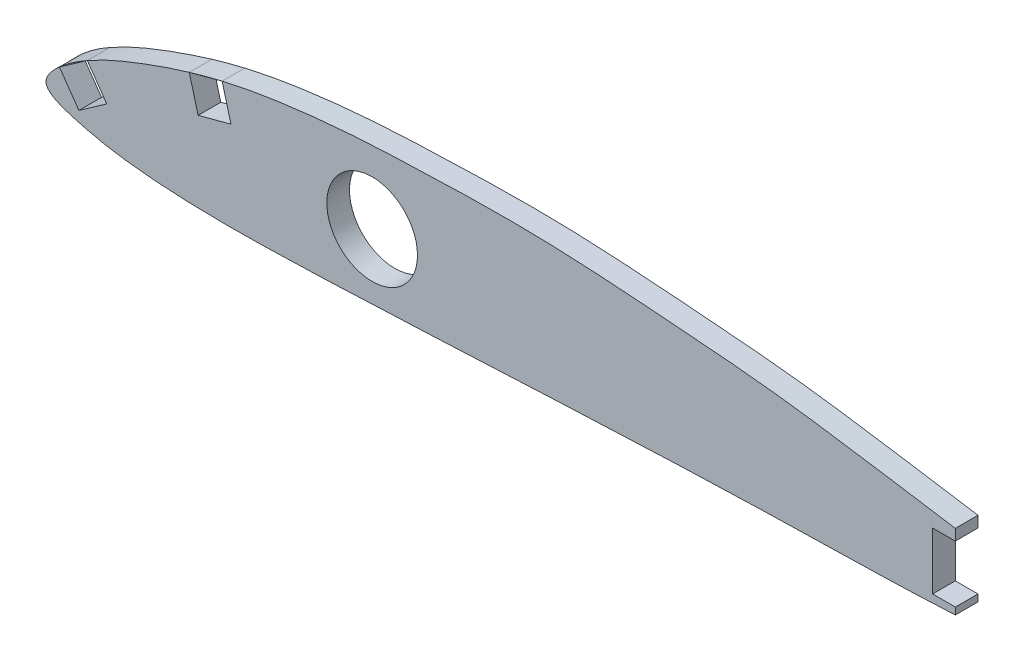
ISO-10303-21;
HEADER;
FILE_DESCRIPTION(('STEP AP214'),'2;1');
FILE_NAME('part.step','',(''),(''),'','','');
FILE_SCHEMA(('AUTOMOTIVE_DESIGN { 1 0 10303 214 1 1 1 1 }'));
ENDSEC;
DATA;
#1=APPLICATION_CONTEXT('core data for automotive mechanical design processes');
#2=APPLICATION_PROTOCOL_DEFINITION('international standard','automotive_design',2000,#1);
#3=PRODUCT_CONTEXT('',#1,'mechanical');
#4=PRODUCT('Part','Part','',(#3));
#5=PRODUCT_RELATED_PRODUCT_CATEGORY('part','',(#4));
#6=PRODUCT_DEFINITION_FORMATION('','',#4);
#7=PRODUCT_DEFINITION_CONTEXT('part definition',#1,'design');
#8=PRODUCT_DEFINITION('design','',#6,#7);
#9=PRODUCT_DEFINITION_SHAPE('','',#8);
#10=(LENGTH_UNIT() NAMED_UNIT(*) SI_UNIT(.MILLI.,.METRE.));
#11=(NAMED_UNIT(*) PLANE_ANGLE_UNIT() SI_UNIT($,.RADIAN.));
#12=(NAMED_UNIT(*) SI_UNIT($,.STERADIAN.) SOLID_ANGLE_UNIT());
#13=UNCERTAINTY_MEASURE_WITH_UNIT(LENGTH_MEASURE(1.E-05),#10,'distance_accuracy_value','');
#14=(GEOMETRIC_REPRESENTATION_CONTEXT(3) GLOBAL_UNCERTAINTY_ASSIGNED_CONTEXT((#13)) GLOBAL_UNIT_ASSIGNED_CONTEXT((#10,
#11,#12)) REPRESENTATION_CONTEXT('',''));
#15=CARTESIAN_POINT('',(0.,0.,0.));
#16=DIRECTION('',(0.,0.,1.));
#17=DIRECTION('',(1.,0.,0.));
#18=AXIS2_PLACEMENT_3D('',#15,#16,#17);
#19=CARTESIAN_POINT('',(0.,0.,0.));
#20=DIRECTION('',(0.,0.,-1.));
#21=DIRECTION('',(-1.,0.,0.));
#22=AXIS2_PLACEMENT_3D('',#19,#20,#21);
#23=PLANE('',#22);
#24=DIRECTION('',(0.,1.,0.));
#25=VECTOR('',#24,1.);
#26=CARTESIAN_POINT('',(127.362,0.,0.));
#27=LINE('',#26,#25);
#28=CARTESIAN_POINT('',(127.362,8.,0.));
#29=VERTEX_POINT('',#28);
#30=CARTESIAN_POINT('',(127.362,9.54645736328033,0.));
#31=VERTEX_POINT('',#30);
#32=EDGE_CURVE('E157',#29,#31,#27,.T.);
#33=ORIENTED_EDGE('',*,*,#32,.F.);
#34=DIRECTION('',(1.,0.,0.));
#35=VECTOR('',#34,1.);
#36=CARTESIAN_POINT('',(0.,8.,0.));
#37=LINE('',#36,#35);
#38=CARTESIAN_POINT('',(124.187,8.,0.));
#39=VERTEX_POINT('',#38);
#40=EDGE_CURVE('E65',#39,#29,#37,.T.);
#41=ORIENTED_EDGE('',*,*,#40,.F.);
#42=DIRECTION('',(0.,1.,0.));
#43=VECTOR('',#42,1.);
#44=CARTESIAN_POINT('',(124.187,0.,0.));
#45=LINE('',#44,#43);
#46=CARTESIAN_POINT('',(124.187,0.,0.));
#47=VERTEX_POINT('',#46);
#48=EDGE_CURVE('E229',#47,#39,#45,.T.);
#49=ORIENTED_EDGE('',*,*,#48,.F.);
#50=DIRECTION('',(-1.,0.,0.));
#51=VECTOR('',#50,1.);
#52=CARTESIAN_POINT('',(0.,1.60692808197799E-12,0.));
#53=LINE('',#52,#51);
#54=CARTESIAN_POINT('',(127.362,0.,0.));
#55=VERTEX_POINT('',#54);
#56=EDGE_CURVE('E134',#55,#47,#53,.T.);
#57=ORIENTED_EDGE('',*,*,#56,.F.);
#58=DIRECTION('',(0.,1.,0.));
#59=VECTOR('',#58,1.);
#60=CARTESIAN_POINT('',(127.362,0.,0.));
#61=LINE('',#60,#59);
#62=CARTESIAN_POINT('',(127.362,-0.966233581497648,0.));
#63=VERTEX_POINT('',#62);
#64=EDGE_CURVE('E198',#63,#55,#61,.T.);
#65=ORIENTED_EDGE('',*,*,#64,.F.);
#66=CARTESIAN_POINT('',(0.,0.,0.));
#67=CARTESIAN_POINT('',(-0.0472103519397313,0.916800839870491,0.));
#68=CARTESIAN_POINT('',(1.95472681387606,2.97484692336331,0.));
#69=CARTESIAN_POINT('',(4.79809564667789,5.01128965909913,0.));
#70=CARTESIAN_POINT('',(8.48331335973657,6.99574566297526,0.));
#71=CARTESIAN_POINT('',(15.5406404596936,9.86646560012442,0.));
#72=CARTESIAN_POINT('',(24.1015958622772,12.5978770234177,0.));
#73=CARTESIAN_POINT('',(34.2353450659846,14.2184425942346,0.));
#74=CARTESIAN_POINT('',(42.8242854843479,15.0755900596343,0.));
#75=CARTESIAN_POINT('',(54.2570057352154,15.5547360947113,0.));
#76=CARTESIAN_POINT('',(68.5622896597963,15.9604747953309,0.));
#77=CARTESIAN_POINT('',(85.6836883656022,14.7588221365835,0.));
#78=CARTESIAN_POINT('',(102.928702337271,13.4150923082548,0.));
#79=CARTESIAN_POINT('',(119.782412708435,10.7152566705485,0.));
#80=CARTESIAN_POINT('',(137.861885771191,7.95134817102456,0.));
#81=CARTESIAN_POINT('',(151.659475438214,4.70539478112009,0.));
#82=CARTESIAN_POINT('',(181.030093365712,-1.11239211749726,0.));
#83=CARTESIAN_POINT('',(143.027519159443,0.226149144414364,0.));
#84=CARTESIAN_POINT('',(126.501098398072,-1.28628115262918,0.));
#85=CARTESIAN_POINT('',(90.825011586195,-1.84867484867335,0.));
#86=CARTESIAN_POINT('',(62.9371348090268,-3.36825391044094,0.));
#87=CARTESIAN_POINT('',(34.2240872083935,-4.61982857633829,0.));
#88=CARTESIAN_POINT('',(20.1131584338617,-4.85120808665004,0.));
#89=CARTESIAN_POINT('',(9.7268299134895,-3.84526071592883,0.));
#90=CARTESIAN_POINT('',(4.43930579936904,-2.63627209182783,0.));
#91=CARTESIAN_POINT('',(0.0647848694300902,-1.25808896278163,0.));
#92=CARTESIAN_POINT('',(0.,0.,0.));
#93=B_SPLINE_CURVE_WITH_KNOTS('',3,(#66,#67,#68,#69,#70,#71,#72,#73,#74,#75,#76,#77,#78,#79,#80,
#81,#82,#83,#84,#85,#86,#87,#88,#89,#90,#91,#92),.UNSPECIFIED.,.T.,.F.,(4,1,1,1,1,1,1,1,1,1,1,1,
1,1,1,1,1,1,1,1,1,1,1,1,4),(0.,0.0105604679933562,0.0182111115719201,0.0322098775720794,
0.0455249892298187,0.0840694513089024,0.10897429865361,0.133649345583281,0.158232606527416,
0.207343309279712,0.25652270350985,0.30582635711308,0.355445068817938,0.40521420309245,
0.4553904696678,0.506006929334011,0.555121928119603,0.653369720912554,0.702490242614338,
0.849938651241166,0.899083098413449,0.948194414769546,0.972905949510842,0.985508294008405,1.),.UNSPECIFIED.);
#94=CARTESIAN_POINT('',(1.8788598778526,2.76698132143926,0.));
#95=VERTEX_POINT('',#94);
#96=EDGE_CURVE('E183',#63,#95,#93,.T.);
#97=ORIENTED_EDGE('',*,*,#96,.T.);
#98=DIRECTION('',(-0.573576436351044,0.819152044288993,0.));
#99=VECTOR('',#98,1.);
#100=CARTESIAN_POINT('',(2.56078986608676,1.79308436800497,0.));
#101=LINE('',#100,#99);
#102=CARTESIAN_POINT('',(4.61051765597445,-1.13423028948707,0.));
#103=VERTEX_POINT('',#102);
#104=EDGE_CURVE('E197',#103,#95,#101,.T.);
#105=ORIENTED_EDGE('',*,*,#104,.F.);
#106=DIRECTION('',(-0.819152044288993,-0.573576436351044,0.));
#107=VECTOR('',#106,1.);
#108=CARTESIAN_POINT('',(2.04972778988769,-2.92731465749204,0.));
#109=LINE('',#108,#107);
#110=CARTESIAN_POINT('',(8.51172926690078,1.59742748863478,0.));
#111=VERTEX_POINT('',#110);
#112=EDGE_CURVE('E211',#111,#103,#109,.T.);
#113=ORIENTED_EDGE('',*,*,#112,.F.);
#114=DIRECTION('',(0.573576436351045,-0.819152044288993,0.));
#115=VECTOR('',#114,1.);
#116=CARTESIAN_POINT('',(6.46200147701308,4.52474214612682,0.));
#117=LINE('',#116,#115);
#118=CARTESIAN_POINT('',(5.78007148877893,5.49863909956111,0.));
#119=VERTEX_POINT('',#118);
#120=EDGE_CURVE('E221',#119,#111,#117,.T.);
#121=ORIENTED_EDGE('',*,*,#120,.F.);
#122=CARTESIAN_POINT('',(20.0713171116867,11.2118779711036,0.));
#123=VERTEX_POINT('',#122);
#124=EDGE_CURVE('E181',#119,#123,#93,.T.);
#125=ORIENTED_EDGE('',*,*,#124,.T.);
#126=DIRECTION('',(-0.258819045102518,0.965925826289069,0.));
#127=VECTOR('',#126,1.);
#128=CARTESIAN_POINT('',(21.5297633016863,5.76888268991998,0.));
#129=LINE('',#128,#127);
#130=CARTESIAN_POINT('',(21.3039428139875,6.6116562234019,0.));
#131=VERTEX_POINT('',#130);
#132=EDGE_CURVE('E251',#131,#123,#129,.T.);
#133=ORIENTED_EDGE('',*,*,#132,.F.);
#134=DIRECTION('',(-0.965925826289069,-0.258819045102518,0.));
#135=VECTOR('',#134,1.);
#136=CARTESIAN_POINT('',(-0.225820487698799,0.84277353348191,0.));
#137=LINE('',#136,#135);
#138=CARTESIAN_POINT('',(25.9041645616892,7.84428192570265,0.));
#139=VERTEX_POINT('',#138);
#140=EDGE_CURVE('E244',#139,#131,#137,.T.);
#141=ORIENTED_EDGE('',*,*,#140,.F.);
#142=DIRECTION('',(0.258819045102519,-0.965925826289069,0.));
#143=VECTOR('',#142,1.);
#144=CARTESIAN_POINT('',(26.1299850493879,7.00150839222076,0.));
#145=LINE('',#144,#143);
#146=CARTESIAN_POINT('',(24.6715388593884,12.4445036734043,0.));
#147=VERTEX_POINT('',#146);
#148=EDGE_CURVE('E180',#147,#139,#145,.T.);
#149=ORIENTED_EDGE('',*,*,#148,.F.);
#150=EDGE_CURVE('E172',#147,#31,#93,.T.);
#151=ORIENTED_EDGE('',*,*,#150,.T.);
#152=EDGE_LOOP('',(#33,#41,#49,#57,#65,#97,#105,#113,#121,#125,#133,#141,#149,#151));
#153=FACE_BOUND('',#152,.T.);
#154=CARTESIAN_POINT('',(45.68,4.99999999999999,0.));
#155=DIRECTION('',(0.,0.,-1.));
#156=DIRECTION('',(-1.,0.,0.));
#157=AXIS2_PLACEMENT_3D('',#154,#155,#156);
#158=CIRCLE('',#157,6.35);
#159=CARTESIAN_POINT('',(39.33,4.99999999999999,0.));
#160=VERTEX_POINT('',#159);
#161=EDGE_CURVE('E279',#160,#160,#158,.T.);
#162=ORIENTED_EDGE('',*,*,#161,.F.);
#163=EDGE_LOOP('',(#162));
#164=FACE_BOUND('',#163,.T.);
#165=ADVANCED_FACE('F45',(#153,#164),#23,.T.);
#166=CARTESIAN_POINT('',(0.,0.,3.175));
#167=DIRECTION('',(0.,0.,-1.));
#168=DIRECTION('',(-1.,0.,0.));
#169=AXIS2_PLACEMENT_3D('',#166,#167,#168);
#170=PLANE('',#169);
#171=CARTESIAN_POINT('',(45.68,4.99999999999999,3.175));
#172=DIRECTION('',(0.,0.,1.));
#173=DIRECTION('',(1.,0.,0.));
#174=AXIS2_PLACEMENT_3D('',#171,#172,#173);
#175=CIRCLE('',#174,6.35);
#176=CARTESIAN_POINT('',(52.03,4.99999999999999,3.175));
#177=VERTEX_POINT('',#176);
#178=EDGE_CURVE('E253',#177,#177,#175,.T.);
#179=ORIENTED_EDGE('',*,*,#178,.F.);
#180=EDGE_LOOP('',(#179));
#181=FACE_BOUND('',#180,.T.);
#182=DIRECTION('',(-1.,0.,0.));
#183=VECTOR('',#182,1.);
#184=CARTESIAN_POINT('',(124.187,8.,3.175));
#185=LINE('',#184,#183);
#186=CARTESIAN_POINT('',(127.362,8.,3.175));
#187=VERTEX_POINT('',#186);
#188=CARTESIAN_POINT('',(124.187,8.,3.175));
#189=VERTEX_POINT('',#188);
#190=EDGE_CURVE('E13',#187,#189,#185,.T.);
#191=ORIENTED_EDGE('',*,*,#190,.F.);
#192=DIRECTION('',(0.,-1.,0.));
#193=VECTOR('',#192,1.);
#194=CARTESIAN_POINT('',(127.362,17.1037438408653,3.175));
#195=LINE('',#194,#193);
#196=CARTESIAN_POINT('',(127.362,9.54645736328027,3.175));
#197=VERTEX_POINT('',#196);
#198=EDGE_CURVE('E164',#197,#187,#195,.T.);
#199=ORIENTED_EDGE('',*,*,#198,.F.);
#200=CARTESIAN_POINT('',(0.,0.,3.175));
#201=CARTESIAN_POINT('',(-0.0472103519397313,0.916800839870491,3.175));
#202=CARTESIAN_POINT('',(1.95472681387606,2.97484692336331,3.175));
#203=CARTESIAN_POINT('',(4.79809564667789,5.01128965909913,3.175));
#204=CARTESIAN_POINT('',(8.48331335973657,6.99574566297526,3.175));
#205=CARTESIAN_POINT('',(15.5406404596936,9.86646560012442,3.175));
#206=CARTESIAN_POINT('',(24.1015958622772,12.5978770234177,3.175));
#207=CARTESIAN_POINT('',(34.2353450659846,14.2184425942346,3.175));
#208=CARTESIAN_POINT('',(42.8242854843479,15.0755900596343,3.175));
#209=CARTESIAN_POINT('',(54.2570057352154,15.5547360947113,3.175));
#210=CARTESIAN_POINT('',(68.5622896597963,15.9604747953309,3.175));
#211=CARTESIAN_POINT('',(85.6836883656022,14.7588221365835,3.175));
#212=CARTESIAN_POINT('',(102.928702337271,13.4150923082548,3.175));
#213=CARTESIAN_POINT('',(119.782412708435,10.7152566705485,3.175));
#214=CARTESIAN_POINT('',(137.861885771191,7.95134817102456,3.175));
#215=CARTESIAN_POINT('',(151.659475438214,4.70539478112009,3.175));
#216=CARTESIAN_POINT('',(181.030093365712,-1.11239211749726,3.175));
#217=CARTESIAN_POINT('',(143.027519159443,0.226149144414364,3.175));
#218=CARTESIAN_POINT('',(126.501098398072,-1.28628115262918,3.175));
#219=CARTESIAN_POINT('',(90.825011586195,-1.84867484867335,3.175));
#220=CARTESIAN_POINT('',(62.9371348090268,-3.36825391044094,3.175));
#221=CARTESIAN_POINT('',(34.2240872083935,-4.61982857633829,3.175));
#222=CARTESIAN_POINT('',(20.1131584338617,-4.85120808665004,3.175));
#223=CARTESIAN_POINT('',(9.7268299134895,-3.84526071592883,3.175));
#224=CARTESIAN_POINT('',(4.43930579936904,-2.63627209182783,3.175));
#225=CARTESIAN_POINT('',(0.0647848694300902,-1.25808896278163,3.175));
#226=CARTESIAN_POINT('',(0.,0.,3.175));
#227=B_SPLINE_CURVE_WITH_KNOTS('',3,(#200,#201,#202,#203,#204,#205,#206,#207,#208,#209,#210,
#211,#212,#213,#214,#215,#216,#217,#218,#219,#220,#221,#222,#223,#224,#225,#226),.UNSPECIFIED.,
.T.,.F.,(4,1,1,1,1,1,1,1,1,1,1,1,1,1,1,1,1,1,1,1,1,1,1,1,4),(0.,0.0105604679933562,
0.0182111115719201,0.0322098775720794,0.0455249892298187,0.0840694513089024,0.10897429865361,
0.133649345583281,0.158232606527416,0.207343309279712,0.25652270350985,0.30582635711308,
0.355445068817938,0.40521420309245,0.4553904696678,0.506006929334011,0.555121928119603,
0.653369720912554,0.702490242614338,0.849938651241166,0.899083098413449,0.948194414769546,
0.972905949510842,0.985508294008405,1.),.UNSPECIFIED.);
#228=CARTESIAN_POINT('',(24.6715388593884,12.4445036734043,3.175));
#229=VERTEX_POINT('',#228);
#230=EDGE_CURVE('E175',#229,#197,#227,.T.);
#231=ORIENTED_EDGE('',*,*,#230,.F.);
#232=DIRECTION('',(-0.258819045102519,0.965925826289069,0.));
#233=VECTOR('',#232,1.);
#234=CARTESIAN_POINT('',(24.6715388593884,12.4445036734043,3.175));
#235=LINE('',#234,#233);
#236=CARTESIAN_POINT('',(25.9041645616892,7.84428192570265,3.175));
#237=VERTEX_POINT('',#236);
#238=EDGE_CURVE('E246',#237,#229,#235,.T.);
#239=ORIENTED_EDGE('',*,*,#238,.F.);
#240=DIRECTION('',(0.965925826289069,0.258819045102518,0.));
#241=VECTOR('',#240,1.);
#242=CARTESIAN_POINT('',(21.3039428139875,6.6116562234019,3.175));
#243=LINE('',#242,#241);
#244=CARTESIAN_POINT('',(21.3039428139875,6.6116562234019,3.175));
#245=VERTEX_POINT('',#244);
#246=EDGE_CURVE('E249',#245,#237,#243,.T.);
#247=ORIENTED_EDGE('',*,*,#246,.F.);
#248=DIRECTION('',(0.258819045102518,-0.965925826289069,0.));
#249=VECTOR('',#248,1.);
#250=CARTESIAN_POINT('',(20.0713171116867,11.2118779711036,3.175));
#251=LINE('',#250,#249);
#252=CARTESIAN_POINT('',(20.0713171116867,11.2118779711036,3.175));
#253=VERTEX_POINT('',#252);
#254=EDGE_CURVE('E256',#253,#245,#251,.T.);
#255=ORIENTED_EDGE('',*,*,#254,.F.);
#256=CARTESIAN_POINT('',(5.78007148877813,5.49863909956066,3.175));
#257=VERTEX_POINT('',#256);
#258=EDGE_CURVE('E184',#257,#253,#227,.T.);
#259=ORIENTED_EDGE('',*,*,#258,.F.);
#260=DIRECTION('',(-0.573576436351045,0.819152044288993,0.));
#261=VECTOR('',#260,1.);
#262=CARTESIAN_POINT('',(5.78007148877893,5.49863909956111,3.175));
#263=LINE('',#262,#261);
#264=CARTESIAN_POINT('',(8.51172926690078,1.59742748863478,3.175));
#265=VERTEX_POINT('',#264);
#266=EDGE_CURVE('E212',#265,#257,#263,.T.);
#267=ORIENTED_EDGE('',*,*,#266,.F.);
#268=DIRECTION('',(0.819152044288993,0.573576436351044,0.));
#269=VECTOR('',#268,1.);
#270=CARTESIAN_POINT('',(8.51172926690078,1.59742748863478,3.175));
#271=LINE('',#270,#269);
#272=CARTESIAN_POINT('',(4.61051765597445,-1.13423028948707,3.175));
#273=VERTEX_POINT('',#272);
#274=EDGE_CURVE('E207',#273,#265,#271,.T.);
#275=ORIENTED_EDGE('',*,*,#274,.F.);
#276=DIRECTION('',(0.573576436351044,-0.819152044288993,0.));
#277=VECTOR('',#276,1.);
#278=CARTESIAN_POINT('',(1.8788598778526,2.76698132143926,3.175));
#279=LINE('',#278,#277);
#280=CARTESIAN_POINT('',(1.8788598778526,2.76698132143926,3.175));
#281=VERTEX_POINT('',#280);
#282=EDGE_CURVE('E165',#281,#273,#279,.T.);
#283=ORIENTED_EDGE('',*,*,#282,.F.);
#284=CARTESIAN_POINT('',(127.362000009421,-0.966233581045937,3.175));
#285=VERTEX_POINT('',#284);
#286=EDGE_CURVE('E185',#285,#281,#227,.T.);
#287=ORIENTED_EDGE('',*,*,#286,.F.);
#288=DIRECTION('',(0.,-1.,0.));
#289=VECTOR('',#288,1.);
#290=CARTESIAN_POINT('',(127.362,0.,3.175));
#291=LINE('',#290,#289);
#292=CARTESIAN_POINT('',(127.362,0.,3.175));
#293=VERTEX_POINT('',#292);
#294=EDGE_CURVE('E234',#293,#285,#291,.T.);
#295=ORIENTED_EDGE('',*,*,#294,.F.);
#296=DIRECTION('',(1.,0.,0.));
#297=VECTOR('',#296,1.);
#298=CARTESIAN_POINT('',(124.187,0.,3.175));
#299=LINE('',#298,#297);
#300=CARTESIAN_POINT('',(124.187,0.,3.175));
#301=VERTEX_POINT('',#300);
#302=EDGE_CURVE('E231',#301,#293,#299,.T.);
#303=ORIENTED_EDGE('',*,*,#302,.F.);
#304=DIRECTION('',(0.,-1.,0.));
#305=VECTOR('',#304,1.);
#306=CARTESIAN_POINT('',(124.187,8.,3.175));
#307=LINE('',#306,#305);
#308=EDGE_CURVE('E228',#189,#301,#307,.T.);
#309=ORIENTED_EDGE('',*,*,#308,.F.);
#310=EDGE_LOOP('',(#191,#199,#231,#239,#247,#255,#259,#267,#275,#283,#287,#295,#303,#309));
#311=FACE_BOUND('',#310,.T.);
#312=ADVANCED_FACE('F273',(#181,#311),#170,.F.);
#313=DIRECTION('',(0.,0.,1.));
#314=VECTOR('',#313,1.);
#315=SURFACE_OF_LINEAR_EXTRUSION('',#93,#314);
#316=ORIENTED_EDGE('',*,*,#230,.T.);
#317=DIRECTION('',(0.,0.,1.));
#318=VECTOR('',#317,1.);
#319=CARTESIAN_POINT('',(127.362,9.54645736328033,0.));
#320=LINE('',#319,#318);
#321=EDGE_CURVE('E160',#197,#31,#320,.F.);
#322=ORIENTED_EDGE('',*,*,#321,.T.);
#323=ORIENTED_EDGE('',*,*,#150,.F.);
#324=DIRECTION('',(0.,0.,1.));
#325=VECTOR('',#324,1.);
#326=CARTESIAN_POINT('',(24.6715388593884,12.4445036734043,0.));
#327=LINE('',#326,#325);
#328=EDGE_CURVE('E176',#147,#229,#327,.T.);
#329=ORIENTED_EDGE('',*,*,#328,.T.);
#330=EDGE_LOOP('',(#316,#322,#323,#329));
#331=FACE_BOUND('',#330,.T.);
#332=ADVANCED_FACE('F170',(#331),#315,.F.);
#333=ORIENTED_EDGE('',*,*,#96,.F.);
#334=DIRECTION('',(0.,0.,1.));
#335=VECTOR('',#334,1.);
#336=CARTESIAN_POINT('',(127.362,-0.966233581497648,0.));
#337=LINE('',#336,#335);
#338=EDGE_CURVE('E202',#63,#285,#337,.T.);
#339=ORIENTED_EDGE('',*,*,#338,.T.);
#340=ORIENTED_EDGE('',*,*,#286,.T.);
#341=DIRECTION('',(0.,0.,1.));
#342=VECTOR('',#341,1.);
#343=CARTESIAN_POINT('',(1.87885987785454,2.76698132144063,0.));
#344=LINE('',#343,#342);
#345=EDGE_CURVE('E152',#95,#281,#344,.T.);
#346=ORIENTED_EDGE('',*,*,#345,.F.);
#347=EDGE_LOOP('',(#333,#339,#340,#346));
#348=FACE_BOUND('',#347,.T.);
#349=ADVANCED_FACE('F201',(#348),#315,.F.);
#350=DIRECTION('',(0.,0.,1.));
#351=VECTOR('',#350,1.);
#352=CARTESIAN_POINT('',(5.78007148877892,5.49863909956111,0.));
#353=LINE('',#352,#351);
#354=EDGE_CURVE('E210',#257,#119,#353,.F.);
#355=ORIENTED_EDGE('',*,*,#354,.F.);
#356=ORIENTED_EDGE('',*,*,#258,.T.);
#357=DIRECTION('',(0.,0.,1.));
#358=VECTOR('',#357,1.);
#359=CARTESIAN_POINT('',(20.0713171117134,11.2118779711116,0.));
#360=LINE('',#359,#358);
#361=EDGE_CURVE('E48',#123,#253,#360,.T.);
#362=ORIENTED_EDGE('',*,*,#361,.F.);
#363=ORIENTED_EDGE('',*,*,#124,.F.);
#364=EDGE_LOOP('',(#355,#356,#362,#363));
#365=FACE_BOUND('',#364,.T.);
#366=ADVANCED_FACE('F300',(#365),#315,.F.);
#367=CARTESIAN_POINT('',(45.68,4.99999999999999,-6.825));
#368=DIRECTION('',(0.,0.,1.));
#369=DIRECTION('',(1.,0.,0.));
#370=AXIS2_PLACEMENT_3D('',#367,#368,#369);
#371=CYLINDRICAL_SURFACE('',#370,6.35);
#372=ORIENTED_EDGE('',*,*,#161,.T.);
#373=EDGE_LOOP('',(#372));
#374=FACE_BOUND('',#373,.T.);
#375=ORIENTED_EDGE('',*,*,#178,.T.);
#376=EDGE_LOOP('',(#375));
#377=FACE_BOUND('',#376,.T.);
#378=ADVANCED_FACE('F292',(#374,#377),#371,.F.);
#379=CARTESIAN_POINT('',(20.0713171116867,11.2118779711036,-6.825));
#380=DIRECTION('',(-0.965925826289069,-0.258819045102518,0.));
#381=DIRECTION('',(0.258819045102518,-0.965925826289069,0.));
#382=AXIS2_PLACEMENT_3D('',#379,#380,#381);
#383=PLANE('',#382);
#384=ORIENTED_EDGE('',*,*,#132,.T.);
#385=ORIENTED_EDGE('',*,*,#361,.T.);
#386=ORIENTED_EDGE('',*,*,#254,.T.);
#387=DIRECTION('',(0.,0.,1.));
#388=VECTOR('',#387,1.);
#389=CARTESIAN_POINT('',(21.3039428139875,6.6116562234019,-6.825));
#390=LINE('',#389,#388);
#391=EDGE_CURVE('E245',#131,#245,#390,.T.);
#392=ORIENTED_EDGE('',*,*,#391,.F.);
#393=EDGE_LOOP('',(#384,#385,#386,#392));
#394=FACE_BOUND('',#393,.T.);
#395=ADVANCED_FACE('F330',(#394),#383,.F.);
#396=CARTESIAN_POINT('',(24.6715388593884,12.4445036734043,-6.825));
#397=DIRECTION('',(0.965925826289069,0.258819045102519,0.));
#398=DIRECTION('',(-0.258819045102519,0.965925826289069,0.));
#399=AXIS2_PLACEMENT_3D('',#396,#397,#398);
#400=PLANE('',#399);
#401=ORIENTED_EDGE('',*,*,#148,.T.);
#402=DIRECTION('',(0.,0.,1.));
#403=VECTOR('',#402,1.);
#404=CARTESIAN_POINT('',(25.9041645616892,7.84428192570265,-6.825));
#405=LINE('',#404,#403);
#406=EDGE_CURVE('E255',#139,#237,#405,.T.);
#407=ORIENTED_EDGE('',*,*,#406,.T.);
#408=ORIENTED_EDGE('',*,*,#238,.T.);
#409=ORIENTED_EDGE('',*,*,#328,.F.);
#410=EDGE_LOOP('',(#401,#407,#408,#409));
#411=FACE_BOUND('',#410,.T.);
#412=ADVANCED_FACE('F327',(#411),#400,.F.);
#413=CARTESIAN_POINT('',(21.3039428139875,6.6116562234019,-6.825));
#414=DIRECTION('',(0.258819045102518,-0.965925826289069,0.));
#415=DIRECTION('',(0.965925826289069,0.258819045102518,0.));
#416=AXIS2_PLACEMENT_3D('',#413,#414,#415);
#417=PLANE('',#416);
#418=ORIENTED_EDGE('',*,*,#140,.T.);
#419=ORIENTED_EDGE('',*,*,#391,.T.);
#420=ORIENTED_EDGE('',*,*,#246,.T.);
#421=ORIENTED_EDGE('',*,*,#406,.F.);
#422=EDGE_LOOP('',(#418,#419,#420,#421));
#423=FACE_BOUND('',#422,.T.);
#424=ADVANCED_FACE('F326',(#423),#417,.F.);
#425=CARTESIAN_POINT('',(5.78007148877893,5.49863909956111,-6.825));
#426=DIRECTION('',(0.819152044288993,0.573576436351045,0.));
#427=DIRECTION('',(-0.573576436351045,0.819152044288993,0.));
#428=AXIS2_PLACEMENT_3D('',#425,#426,#427);
#429=PLANE('',#428);
#430=ORIENTED_EDGE('',*,*,#120,.T.);
#431=DIRECTION('',(0.,0.,1.));
#432=VECTOR('',#431,1.);
#433=CARTESIAN_POINT('',(8.51172926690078,1.59742748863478,-6.825));
#434=LINE('',#433,#432);
#435=EDGE_CURVE('E218',#111,#265,#434,.T.);
#436=ORIENTED_EDGE('',*,*,#435,.T.);
#437=ORIENTED_EDGE('',*,*,#266,.T.);
#438=ORIENTED_EDGE('',*,*,#354,.T.);
#439=EDGE_LOOP('',(#430,#436,#437,#438));
#440=FACE_BOUND('',#439,.T.);
#441=ADVANCED_FACE('F321',(#440),#429,.F.);
#442=CARTESIAN_POINT('',(8.51172926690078,1.59742748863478,-6.825));
#443=DIRECTION('',(0.573576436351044,-0.819152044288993,0.));
#444=DIRECTION('',(0.819152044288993,0.573576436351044,0.));
#445=AXIS2_PLACEMENT_3D('',#442,#443,#444);
#446=PLANE('',#445);
#447=ORIENTED_EDGE('',*,*,#112,.T.);
#448=DIRECTION('',(0.,0.,1.));
#449=VECTOR('',#448,1.);
#450=CARTESIAN_POINT('',(4.61051765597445,-1.13423028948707,-6.825));
#451=LINE('',#450,#449);
#452=EDGE_CURVE('E216',#103,#273,#451,.T.);
#453=ORIENTED_EDGE('',*,*,#452,.T.);
#454=ORIENTED_EDGE('',*,*,#274,.T.);
#455=ORIENTED_EDGE('',*,*,#435,.F.);
#456=EDGE_LOOP('',(#447,#453,#454,#455));
#457=FACE_BOUND('',#456,.T.);
#458=ADVANCED_FACE('F268',(#457),#446,.F.);
#459=CARTESIAN_POINT('',(1.8788598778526,2.76698132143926,-6.825));
#460=DIRECTION('',(-0.819152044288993,-0.573576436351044,0.));
#461=DIRECTION('',(0.573576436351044,-0.819152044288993,0.));
#462=AXIS2_PLACEMENT_3D('',#459,#460,#461);
#463=PLANE('',#462);
#464=ORIENTED_EDGE('',*,*,#104,.T.);
#465=ORIENTED_EDGE('',*,*,#345,.T.);
#466=ORIENTED_EDGE('',*,*,#282,.T.);
#467=ORIENTED_EDGE('',*,*,#452,.F.);
#468=EDGE_LOOP('',(#464,#465,#466,#467));
#469=FACE_BOUND('',#468,.T.);
#470=ADVANCED_FACE('F318',(#469),#463,.F.);
#471=CARTESIAN_POINT('',(127.362,17.1037438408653,-6.825));
#472=DIRECTION('',(-1.,0.,0.));
#473=DIRECTION('',(0.,0.,1.));
#474=AXIS2_PLACEMENT_3D('',#471,#472,#473);
#475=PLANE('',#474);
#476=ORIENTED_EDGE('',*,*,#32,.T.);
#477=ORIENTED_EDGE('',*,*,#321,.F.);
#478=ORIENTED_EDGE('',*,*,#198,.T.);
#479=DIRECTION('',(0.,0.,1.));
#480=VECTOR('',#479,1.);
#481=CARTESIAN_POINT('',(127.362,8.,-6.825));
#482=LINE('',#481,#480);
#483=EDGE_CURVE('E53',#29,#187,#482,.T.);
#484=ORIENTED_EDGE('',*,*,#483,.F.);
#485=EDGE_LOOP('',(#476,#477,#478,#484));
#486=FACE_BOUND('',#485,.T.);
#487=ADVANCED_FACE('F159',(#486),#475,.F.);
#488=CARTESIAN_POINT('',(127.362,0.,-6.825));
#489=DIRECTION('',(-1.,0.,0.));
#490=DIRECTION('',(0.,0.,1.));
#491=AXIS2_PLACEMENT_3D('',#488,#489,#490);
#492=PLANE('',#491);
#493=ORIENTED_EDGE('',*,*,#64,.T.);
#494=DIRECTION('',(0.,0.,1.));
#495=VECTOR('',#494,1.);
#496=CARTESIAN_POINT('',(127.362,0.,-6.825));
#497=LINE('',#496,#495);
#498=EDGE_CURVE('E232',#55,#293,#497,.T.);
#499=ORIENTED_EDGE('',*,*,#498,.T.);
#500=ORIENTED_EDGE('',*,*,#294,.T.);
#501=ORIENTED_EDGE('',*,*,#338,.F.);
#502=EDGE_LOOP('',(#493,#499,#500,#501));
#503=FACE_BOUND('',#502,.T.);
#504=ADVANCED_FACE('F303',(#503),#492,.F.);
#505=CARTESIAN_POINT('',(124.187,0.,-6.825));
#506=DIRECTION('',(0.,-1.,0.));
#507=DIRECTION('',(1.,0.,0.));
#508=AXIS2_PLACEMENT_3D('',#505,#506,#507);
#509=PLANE('',#508);
#510=ORIENTED_EDGE('',*,*,#56,.T.);
#511=DIRECTION('',(0.,0.,1.));
#512=VECTOR('',#511,1.);
#513=CARTESIAN_POINT('',(124.187,0.,-6.825));
#514=LINE('',#513,#512);
#515=EDGE_CURVE('E128',#47,#301,#514,.T.);
#516=ORIENTED_EDGE('',*,*,#515,.T.);
#517=ORIENTED_EDGE('',*,*,#302,.T.);
#518=ORIENTED_EDGE('',*,*,#498,.F.);
#519=EDGE_LOOP('',(#510,#516,#517,#518));
#520=FACE_BOUND('',#519,.T.);
#521=ADVANCED_FACE('F306',(#520),#509,.F.);
#522=CARTESIAN_POINT('',(124.187,8.,-6.825));
#523=DIRECTION('',(-1.,0.,0.));
#524=DIRECTION('',(0.,0.,1.));
#525=AXIS2_PLACEMENT_3D('',#522,#523,#524);
#526=PLANE('',#525);
#527=ORIENTED_EDGE('',*,*,#48,.T.);
#528=DIRECTION('',(0.,0.,1.));
#529=VECTOR('',#528,1.);
#530=CARTESIAN_POINT('',(124.187,8.,-6.825));
#531=LINE('',#530,#529);
#532=EDGE_CURVE('E226',#39,#189,#531,.T.);
#533=ORIENTED_EDGE('',*,*,#532,.T.);
#534=ORIENTED_EDGE('',*,*,#308,.T.);
#535=ORIENTED_EDGE('',*,*,#515,.F.);
#536=EDGE_LOOP('',(#527,#533,#534,#535));
#537=FACE_BOUND('',#536,.T.);
#538=ADVANCED_FACE('F310',(#537),#526,.F.);
#539=CARTESIAN_POINT('',(124.187,8.,-6.825));
#540=DIRECTION('',(0.,1.,0.));
#541=DIRECTION('',(0.,0.,1.));
#542=AXIS2_PLACEMENT_3D('',#539,#540,#541);
#543=PLANE('',#542);
#544=ORIENTED_EDGE('',*,*,#40,.T.);
#545=ORIENTED_EDGE('',*,*,#483,.T.);
#546=ORIENTED_EDGE('',*,*,#190,.T.);
#547=ORIENTED_EDGE('',*,*,#532,.F.);
#548=EDGE_LOOP('',(#544,#545,#546,#547));
#549=FACE_BOUND('',#548,.T.);
#550=ADVANCED_FACE('F313',(#549),#543,.F.);
#551=CLOSED_SHELL('',(#165,#312,#332,#349,#366,#378,#395,#412,#424,#441,#458,#470,#487,#504,
#521,#538,#550));
#552=MANIFOLD_SOLID_BREP('B2',#551);
#553=CARTESIAN_POINT('',(0.,0.,0.));
#554=CARTESIAN_POINT('',(-0.0472103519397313,0.916800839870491,0.));
#555=CARTESIAN_POINT('',(1.95472681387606,2.97484692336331,0.));
#556=CARTESIAN_POINT('',(4.79809564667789,5.01128965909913,0.));
#557=CARTESIAN_POINT('',(8.48331335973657,6.99574566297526,0.));
#558=CARTESIAN_POINT('',(15.5406404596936,9.86646560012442,0.));
#559=CARTESIAN_POINT('',(24.1015958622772,12.5978770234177,0.));
#560=CARTESIAN_POINT('',(34.2353450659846,14.2184425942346,0.));
#561=CARTESIAN_POINT('',(42.8242854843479,15.0755900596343,0.));
#562=CARTESIAN_POINT('',(54.2570057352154,15.5547360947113,0.));
#563=CARTESIAN_POINT('',(68.5622896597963,15.9604747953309,0.));
#564=CARTESIAN_POINT('',(85.6836883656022,14.7588221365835,0.));
#565=CARTESIAN_POINT('',(102.928702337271,13.4150923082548,0.));
#566=CARTESIAN_POINT('',(119.782412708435,10.7152566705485,0.));
#567=CARTESIAN_POINT('',(137.861885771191,7.95134817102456,0.));
#568=CARTESIAN_POINT('',(151.659475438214,4.70539478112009,0.));
#569=CARTESIAN_POINT('',(181.030093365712,-1.11239211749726,0.));
#570=CARTESIAN_POINT('',(143.027519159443,0.226149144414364,0.));
#571=CARTESIAN_POINT('',(126.501098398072,-1.28628115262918,0.));
#572=CARTESIAN_POINT('',(90.825011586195,-1.84867484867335,0.));
#573=CARTESIAN_POINT('',(62.9371348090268,-3.36825391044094,0.));
#574=CARTESIAN_POINT('',(34.2240872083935,-4.61982857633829,0.));
#575=CARTESIAN_POINT('',(20.1131584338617,-4.85120808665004,0.));
#576=CARTESIAN_POINT('',(9.7268299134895,-3.84526071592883,0.));
#577=CARTESIAN_POINT('',(4.43930579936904,-2.63627209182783,0.));
#578=CARTESIAN_POINT('',(0.0647848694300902,-1.25808896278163,0.));
#579=CARTESIAN_POINT('',(0.,0.,0.));
#580=B_SPLINE_CURVE_WITH_KNOTS('',3,(#553,#554,#555,#556,#557,#558,#559,#560,#561,#562,#563,
#564,#565,#566,#567,#568,#569,#570,#571,#572,#573,#574,#575,#576,#577,#578,#579),.UNSPECIFIED.,
.T.,.F.,(4,1,1,1,1,1,1,1,1,1,1,1,1,1,1,1,1,1,1,1,1,1,1,1,4),(0.,0.0105604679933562,
0.0182111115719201,0.0322098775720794,0.0455249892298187,0.0840694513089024,0.10897429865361,
0.133649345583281,0.158232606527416,0.207343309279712,0.25652270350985,0.30582635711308,
0.355445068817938,0.40521420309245,0.4553904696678,0.506006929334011,0.555121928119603,
0.653369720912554,0.702490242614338,0.849938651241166,0.899083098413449,0.948194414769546,
0.972905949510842,0.985508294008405,1.),.UNSPECIFIED.);
#581=DIRECTION('',(0.,0.,1.));
#582=VECTOR('',#581,1.);
#583=SURFACE_OF_LINEAR_EXTRUSION('',#580,#582);
#584=CARTESIAN_POINT('',(20.0713171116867,11.2118779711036,0.));
#585=VERTEX_POINT('',#584);
#586=CARTESIAN_POINT('',(24.6715388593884,12.4445036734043,0.));
#587=VERTEX_POINT('',#586);
#588=EDGE_CURVE('E496',#585,#587,#580,.T.);
#589=ORIENTED_EDGE('',*,*,#588,.F.);
#590=DIRECTION('',(0.,0.,1.));
#591=VECTOR('',#590,1.);
#592=CARTESIAN_POINT('',(20.0713171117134,11.2118779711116,0.));
#593=LINE('',#592,#591);
#594=CARTESIAN_POINT('',(20.0713171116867,11.2118779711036,3.175));
#595=VERTEX_POINT('',#594);
#596=EDGE_CURVE('E483',#585,#595,#593,.T.);
#597=ORIENTED_EDGE('',*,*,#596,.T.);
#598=CARTESIAN_POINT('',(0.,0.,3.175));
#599=CARTESIAN_POINT('',(-0.0472103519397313,0.916800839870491,3.175));
#600=CARTESIAN_POINT('',(1.95472681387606,2.97484692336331,3.175));
#601=CARTESIAN_POINT('',(4.79809564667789,5.01128965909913,3.175));
#602=CARTESIAN_POINT('',(8.48331335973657,6.99574566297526,3.175));
#603=CARTESIAN_POINT('',(15.5406404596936,9.86646560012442,3.175));
#604=CARTESIAN_POINT('',(24.1015958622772,12.5978770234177,3.175));
#605=CARTESIAN_POINT('',(34.2353450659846,14.2184425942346,3.175));
#606=CARTESIAN_POINT('',(42.8242854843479,15.0755900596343,3.175));
#607=CARTESIAN_POINT('',(54.2570057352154,15.5547360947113,3.175));
#608=CARTESIAN_POINT('',(68.5622896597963,15.9604747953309,3.175));
#609=CARTESIAN_POINT('',(85.6836883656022,14.7588221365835,3.175));
#610=CARTESIAN_POINT('',(102.928702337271,13.4150923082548,3.175));
#611=CARTESIAN_POINT('',(119.782412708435,10.7152566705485,3.175));
#612=CARTESIAN_POINT('',(137.861885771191,7.95134817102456,3.175));
#613=CARTESIAN_POINT('',(151.659475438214,4.70539478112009,3.175));
#614=CARTESIAN_POINT('',(181.030093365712,-1.11239211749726,3.175));
#615=CARTESIAN_POINT('',(143.027519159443,0.226149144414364,3.175));
#616=CARTESIAN_POINT('',(126.501098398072,-1.28628115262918,3.175));
#617=CARTESIAN_POINT('',(90.825011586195,-1.84867484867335,3.175));
#618=CARTESIAN_POINT('',(62.9371348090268,-3.36825391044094,3.175));
#619=CARTESIAN_POINT('',(34.2240872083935,-4.61982857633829,3.175));
#620=CARTESIAN_POINT('',(20.1131584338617,-4.85120808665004,3.175));
#621=CARTESIAN_POINT('',(9.7268299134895,-3.84526071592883,3.175));
#622=CARTESIAN_POINT('',(4.43930579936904,-2.63627209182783,3.175));
#623=CARTESIAN_POINT('',(0.0647848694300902,-1.25808896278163,3.175));
#624=CARTESIAN_POINT('',(0.,0.,3.175));
#625=B_SPLINE_CURVE_WITH_KNOTS('',3,(#598,#599,#600,#601,#602,#603,#604,#605,#606,#607,#608,
#609,#610,#611,#612,#613,#614,#615,#616,#617,#618,#619,#620,#621,#622,#623,#624),.UNSPECIFIED.,
.T.,.F.,(4,1,1,1,1,1,1,1,1,1,1,1,1,1,1,1,1,1,1,1,1,1,1,1,4),(0.,0.0105604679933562,
0.0182111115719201,0.0322098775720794,0.0455249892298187,0.0840694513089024,0.10897429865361,
0.133649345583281,0.158232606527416,0.207343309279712,0.25652270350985,0.30582635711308,
0.355445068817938,0.40521420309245,0.4553904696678,0.506006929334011,0.555121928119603,
0.653369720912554,0.702490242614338,0.849938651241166,0.899083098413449,0.948194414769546,
0.972905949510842,0.985508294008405,1.),.UNSPECIFIED.);
#626=CARTESIAN_POINT('',(24.6715388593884,12.4445036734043,3.175));
#627=VERTEX_POINT('',#626);
#628=EDGE_CURVE('E468',#595,#627,#625,.T.);
#629=ORIENTED_EDGE('',*,*,#628,.T.);
#630=DIRECTION('',(0.,0.,1.));
#631=VECTOR('',#630,1.);
#632=CARTESIAN_POINT('',(24.6715388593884,12.4445036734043,0.));
#633=LINE('',#632,#631);
#634=EDGE_CURVE('E476',#587,#627,#633,.T.);
#635=ORIENTED_EDGE('',*,*,#634,.F.);
#636=EDGE_LOOP('',(#589,#597,#629,#635));
#637=FACE_BOUND('',#636,.T.);
#638=ADVANCED_FACE('F464',(#637),#583,.F.);
#639=CARTESIAN_POINT('',(0.,0.,3.175));
#640=DIRECTION('',(0.,0.,-1.));
#641=DIRECTION('',(-1.,0.,0.));
#642=AXIS2_PLACEMENT_3D('',#639,#640,#641);
#643=PLANE('',#642);
#644=ORIENTED_EDGE('',*,*,#628,.F.);
#645=DIRECTION('',(-0.965925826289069,-0.258819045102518,0.));
#646=VECTOR('',#645,1.);
#647=CARTESIAN_POINT('',(20.0713171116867,11.2118779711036,3.175));
#648=LINE('',#647,#646);
#649=EDGE_CURVE('E43',#627,#595,#648,.T.);
#650=ORIENTED_EDGE('',*,*,#649,.F.);
#651=EDGE_LOOP('',(#644,#650));
#652=FACE_BOUND('',#651,.T.);
#653=ADVANCED_FACE('F511',(#652),#643,.F.);
#654=CARTESIAN_POINT('',(0.,0.,0.));
#655=DIRECTION('',(0.,0.,-1.));
#656=DIRECTION('',(-1.,0.,0.));
#657=AXIS2_PLACEMENT_3D('',#654,#655,#656);
#658=PLANE('',#657);
#659=DIRECTION('',(0.965925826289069,0.258819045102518,0.));
#660=VECTOR('',#659,1.);
#661=CARTESIAN_POINT('',(-1.45844618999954,5.4429952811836,0.));
#662=LINE('',#661,#660);
#663=EDGE_CURVE('E490',#585,#587,#662,.T.);
#664=ORIENTED_EDGE('',*,*,#663,.F.);
#665=ORIENTED_EDGE('',*,*,#588,.T.);
#666=EDGE_LOOP('',(#664,#665));
#667=FACE_BOUND('',#666,.T.);
#668=ADVANCED_FACE('F466',(#667),#658,.T.);
#669=CARTESIAN_POINT('',(20.0713171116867,11.2118779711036,-6.825));
#670=DIRECTION('',(-0.258819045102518,0.965925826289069,0.));
#671=DIRECTION('',(-0.965925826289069,-0.258819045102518,0.));
#672=AXIS2_PLACEMENT_3D('',#669,#670,#671);
#673=PLANE('',#672);
#674=ORIENTED_EDGE('',*,*,#663,.T.);
#675=ORIENTED_EDGE('',*,*,#634,.T.);
#676=ORIENTED_EDGE('',*,*,#649,.T.);
#677=ORIENTED_EDGE('',*,*,#596,.F.);
#678=EDGE_LOOP('',(#674,#675,#676,#677));
#679=FACE_BOUND('',#678,.T.);
#680=ADVANCED_FACE('F492',(#679),#673,.F.);
#681=CLOSED_SHELL('',(#638,#653,#668,#680));
#682=MANIFOLD_SOLID_BREP('B7',#681);
#683=CARTESIAN_POINT('',(0.,0.,0.));
#684=CARTESIAN_POINT('',(-0.0472103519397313,0.916800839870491,0.));
#685=CARTESIAN_POINT('',(1.95472681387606,2.97484692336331,0.));
#686=CARTESIAN_POINT('',(4.79809564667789,5.01128965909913,0.));
#687=CARTESIAN_POINT('',(8.48331335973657,6.99574566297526,0.));
#688=CARTESIAN_POINT('',(15.5406404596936,9.86646560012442,0.));
#689=CARTESIAN_POINT('',(24.1015958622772,12.5978770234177,0.));
#690=CARTESIAN_POINT('',(34.2353450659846,14.2184425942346,0.));
#691=CARTESIAN_POINT('',(42.8242854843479,15.0755900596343,0.));
#692=CARTESIAN_POINT('',(54.2570057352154,15.5547360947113,0.));
#693=CARTESIAN_POINT('',(68.5622896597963,15.9604747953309,0.));
#694=CARTESIAN_POINT('',(85.6836883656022,14.7588221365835,0.));
#695=CARTESIAN_POINT('',(102.928702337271,13.4150923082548,0.));
#696=CARTESIAN_POINT('',(119.782412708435,10.7152566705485,0.));
#697=CARTESIAN_POINT('',(137.861885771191,7.95134817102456,0.));
#698=CARTESIAN_POINT('',(151.659475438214,4.70539478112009,0.));
#699=CARTESIAN_POINT('',(181.030093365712,-1.11239211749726,0.));
#700=CARTESIAN_POINT('',(143.027519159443,0.226149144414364,0.));
#701=CARTESIAN_POINT('',(126.501098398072,-1.28628115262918,0.));
#702=CARTESIAN_POINT('',(90.825011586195,-1.84867484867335,0.));
#703=CARTESIAN_POINT('',(62.9371348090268,-3.36825391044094,0.));
#704=CARTESIAN_POINT('',(34.2240872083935,-4.61982857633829,0.));
#705=CARTESIAN_POINT('',(20.1131584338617,-4.85120808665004,0.));
#706=CARTESIAN_POINT('',(9.7268299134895,-3.84526071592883,0.));
#707=CARTESIAN_POINT('',(4.43930579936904,-2.63627209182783,0.));
#708=CARTESIAN_POINT('',(0.0647848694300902,-1.25808896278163,0.));
#709=CARTESIAN_POINT('',(0.,0.,0.));
#710=B_SPLINE_CURVE_WITH_KNOTS('',3,(#683,#684,#685,#686,#687,#688,#689,#690,#691,#692,#693,
#694,#695,#696,#697,#698,#699,#700,#701,#702,#703,#704,#705,#706,#707,#708,#709),.UNSPECIFIED.,
.T.,.F.,(4,1,1,1,1,1,1,1,1,1,1,1,1,1,1,1,1,1,1,1,1,1,1,1,4),(0.,0.0105604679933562,
0.0182111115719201,0.0322098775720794,0.0455249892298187,0.0840694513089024,0.10897429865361,
0.133649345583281,0.158232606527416,0.207343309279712,0.25652270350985,0.30582635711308,
0.355445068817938,0.40521420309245,0.4553904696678,0.506006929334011,0.555121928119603,
0.653369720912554,0.702490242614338,0.849938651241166,0.899083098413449,0.948194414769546,
0.972905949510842,0.985508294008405,1.),.UNSPECIFIED.);
#711=DIRECTION('',(0.,0.,1.));
#712=VECTOR('',#711,1.);
#713=SURFACE_OF_LINEAR_EXTRUSION('',#710,#712);
#714=CARTESIAN_POINT('',(1.8788598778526,2.76698132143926,0.));
#715=VERTEX_POINT('',#714);
#716=CARTESIAN_POINT('',(5.78007148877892,5.49863909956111,0.));
#717=VERTEX_POINT('',#716);
#718=EDGE_CURVE('E579',#715,#717,#710,.T.);
#719=ORIENTED_EDGE('',*,*,#718,.F.);
#720=DIRECTION('',(0.,0.,1.));
#721=VECTOR('',#720,1.);
#722=CARTESIAN_POINT('',(1.87885987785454,2.76698132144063,0.));
#723=LINE('',#722,#721);
#724=CARTESIAN_POINT('',(1.8788598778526,2.76698132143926,3.175));
#725=VERTEX_POINT('',#724);
#726=EDGE_CURVE('E462',#715,#725,#723,.T.);
#727=ORIENTED_EDGE('',*,*,#726,.T.);
#728=CARTESIAN_POINT('',(0.,0.,3.175));
#729=CARTESIAN_POINT('',(-0.0472103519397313,0.916800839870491,3.175));
#730=CARTESIAN_POINT('',(1.95472681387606,2.97484692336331,3.175));
#731=CARTESIAN_POINT('',(4.79809564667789,5.01128965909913,3.175));
#732=CARTESIAN_POINT('',(8.48331335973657,6.99574566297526,3.175));
#733=CARTESIAN_POINT('',(15.5406404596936,9.86646560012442,3.175));
#734=CARTESIAN_POINT('',(24.1015958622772,12.5978770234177,3.175));
#735=CARTESIAN_POINT('',(34.2353450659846,14.2184425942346,3.175));
#736=CARTESIAN_POINT('',(42.8242854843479,15.0755900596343,3.175));
#737=CARTESIAN_POINT('',(54.2570057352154,15.5547360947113,3.175));
#738=CARTESIAN_POINT('',(68.5622896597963,15.9604747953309,3.175));
#739=CARTESIAN_POINT('',(85.6836883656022,14.7588221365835,3.175));
#740=CARTESIAN_POINT('',(102.928702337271,13.4150923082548,3.175));
#741=CARTESIAN_POINT('',(119.782412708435,10.7152566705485,3.175));
#742=CARTESIAN_POINT('',(137.861885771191,7.95134817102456,3.175));
#743=CARTESIAN_POINT('',(151.659475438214,4.70539478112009,3.175));
#744=CARTESIAN_POINT('',(181.030093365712,-1.11239211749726,3.175));
#745=CARTESIAN_POINT('',(143.027519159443,0.226149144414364,3.175));
#746=CARTESIAN_POINT('',(126.501098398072,-1.28628115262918,3.175));
#747=CARTESIAN_POINT('',(90.825011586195,-1.84867484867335,3.175));
#748=CARTESIAN_POINT('',(62.9371348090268,-3.36825391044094,3.175));
#749=CARTESIAN_POINT('',(34.2240872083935,-4.61982857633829,3.175));
#750=CARTESIAN_POINT('',(20.1131584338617,-4.85120808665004,3.175));
#751=CARTESIAN_POINT('',(9.7268299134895,-3.84526071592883,3.175));
#752=CARTESIAN_POINT('',(4.43930579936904,-2.63627209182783,3.175));
#753=CARTESIAN_POINT('',(0.0647848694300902,-1.25808896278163,3.175));
#754=CARTESIAN_POINT('',(0.,0.,3.175));
#755=B_SPLINE_CURVE_WITH_KNOTS('',3,(#728,#729,#730,#731,#732,#733,#734,#735,#736,#737,#738,
#739,#740,#741,#742,#743,#744,#745,#746,#747,#748,#749,#750,#751,#752,#753,#754),.UNSPECIFIED.,
.T.,.F.,(4,1,1,1,1,1,1,1,1,1,1,1,1,1,1,1,1,1,1,1,1,1,1,1,4),(0.,0.0105604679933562,
0.0182111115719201,0.0322098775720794,0.0455249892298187,0.0840694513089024,0.10897429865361,
0.133649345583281,0.158232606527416,0.207343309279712,0.25652270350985,0.30582635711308,
0.355445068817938,0.40521420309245,0.4553904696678,0.506006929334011,0.555121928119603,
0.653369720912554,0.702490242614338,0.849938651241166,0.899083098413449,0.948194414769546,
0.972905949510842,0.985508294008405,1.),.UNSPECIFIED.);
#756=CARTESIAN_POINT('',(5.78007148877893,5.49863909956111,3.175));
#757=VERTEX_POINT('',#756);
#758=EDGE_CURVE('E577',#725,#757,#755,.T.);
#759=ORIENTED_EDGE('',*,*,#758,.T.);
#760=DIRECTION('',(0.,0.,1.));
#761=VECTOR('',#760,1.);
#762=CARTESIAN_POINT('',(5.78007148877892,5.49863909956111,0.));
#763=LINE('',#762,#761);
#764=EDGE_CURVE('E555',#757,#717,#763,.F.);
#765=ORIENTED_EDGE('',*,*,#764,.T.);
#766=EDGE_LOOP('',(#719,#727,#759,#765));
#767=FACE_BOUND('',#766,.T.);
#768=ADVANCED_FACE('F547',(#767),#713,.F.);
#769=CARTESIAN_POINT('',(0.,0.,3.175));
#770=DIRECTION('',(0.,0.,-1.));
#771=DIRECTION('',(-1.,0.,0.));
#772=AXIS2_PLACEMENT_3D('',#769,#770,#771);
#773=PLANE('',#772);
#774=ORIENTED_EDGE('',*,*,#758,.F.);
#775=DIRECTION('',(-0.819152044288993,-0.573576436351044,0.));
#776=VECTOR('',#775,1.);
#777=CARTESIAN_POINT('',(5.78007148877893,5.49863909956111,3.175));
#778=LINE('',#777,#776);
#779=EDGE_CURVE('E570',#757,#725,#778,.T.);
#780=ORIENTED_EDGE('',*,*,#779,.F.);
#781=EDGE_LOOP('',(#774,#780));
#782=FACE_BOUND('',#781,.T.);
#783=ADVANCED_FACE('F581',(#782),#773,.F.);
#784=CARTESIAN_POINT('',(0.,0.,0.));
#785=DIRECTION('',(0.,0.,-1.));
#786=DIRECTION('',(-1.,0.,0.));
#787=AXIS2_PLACEMENT_3D('',#784,#785,#786);
#788=PLANE('',#787);
#789=DIRECTION('',(0.819152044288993,0.573576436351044,0.));
#790=VECTOR('',#789,1.);
#791=CARTESIAN_POINT('',(-0.681929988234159,0.973896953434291,0.));
#792=LINE('',#791,#790);
#793=EDGE_CURVE('E574',#715,#717,#792,.T.);
#794=ORIENTED_EDGE('',*,*,#793,.F.);
#795=ORIENTED_EDGE('',*,*,#718,.T.);
#796=EDGE_LOOP('',(#794,#795));
#797=FACE_BOUND('',#796,.T.);
#798=ADVANCED_FACE('F549',(#797),#788,.T.);
#799=CARTESIAN_POINT('',(5.78007148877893,5.49863909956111,-6.825));
#800=DIRECTION('',(-0.573576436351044,0.819152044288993,0.));
#801=DIRECTION('',(-0.819152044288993,-0.573576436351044,0.));
#802=AXIS2_PLACEMENT_3D('',#799,#800,#801);
#803=PLANE('',#802);
#804=ORIENTED_EDGE('',*,*,#793,.T.);
#805=ORIENTED_EDGE('',*,*,#764,.F.);
#806=ORIENTED_EDGE('',*,*,#779,.T.);
#807=ORIENTED_EDGE('',*,*,#726,.F.);
#808=EDGE_LOOP('',(#804,#805,#806,#807));
#809=FACE_BOUND('',#808,.T.);
#810=ADVANCED_FACE('F571',(#809),#803,.F.);
#811=CLOSED_SHELL('',(#768,#783,#798,#810));
#812=MANIFOLD_SOLID_BREP('B37',#811);
#813=ADVANCED_BREP_SHAPE_REPRESENTATION('',(#18,#552,#682,#812),#14);
#814=SHAPE_DEFINITION_REPRESENTATION(#9,#813);
ENDSEC;
END-ISO-10303-21;
